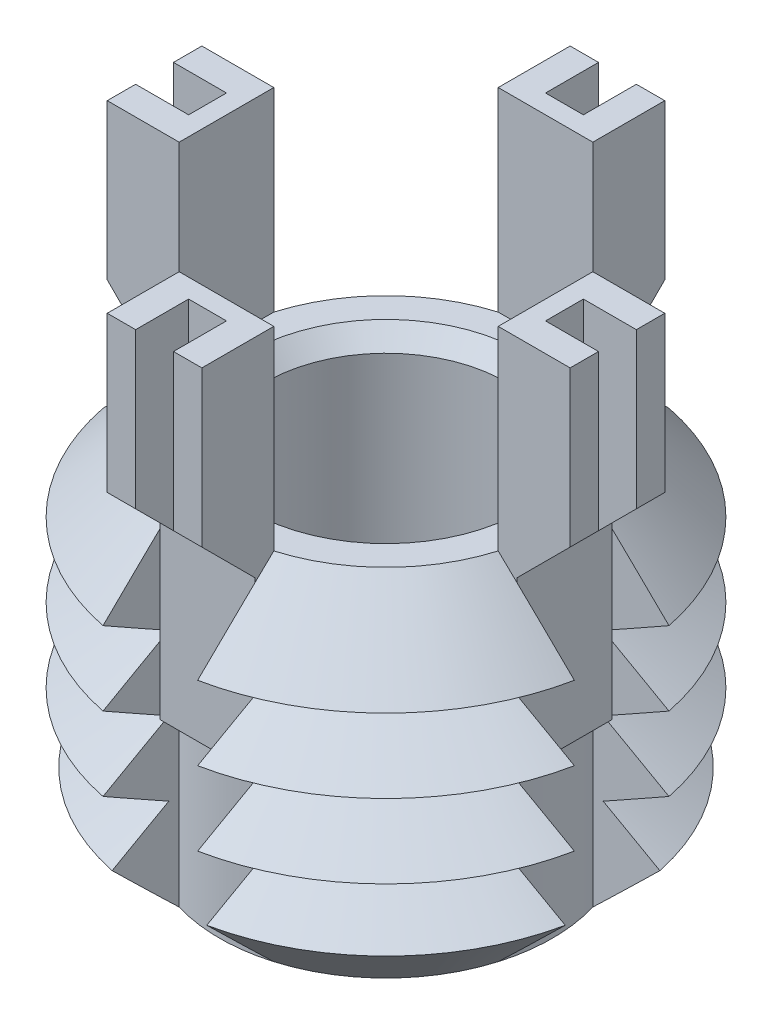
from build123d import *

# Parameters (mm, degrees)
SKETCH1_R               = 6.35
BOSS_EXTRUDE1_DEPTH     = 9.398
CHAMFER1_SIZE           = 1.954
LPATTERN1_COUNT         = 3
LPATTERN1_PITCH         = 1.954
CUT_EXTRUDE1_REACH      = 14.999
CIRPATTERN1_COUNT       = 4
BOSS_EXTRUDE3_DEPTH     = 1.25
CIRPATTERN2_COUNT       = 4
CUT_EXTRUDE3_DEPTH      = 17.994566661
CUT_EXTRUDE3_DEPTH_BACK = 17.994566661
SKETCH6_W               = 1.4
SKETCH6_H               = 1
SKETCH6_W_2             = 1
SKETCH6_H_2             = 1.4
SKETCH7_R               = 3.175
CUT_EXTRUDE4_DEPTH      = 9.398
CHAMFER2_SIZE           = 0.4535


with BuildPart() as part:
    # Sketch1 → Boss-Extrude1 (new body)
    with BuildSketch(Plane(origin=(0, 0, 0), x_dir=(1, 0, 0), z_dir=(0, 1, 0))):
        with Locations(Location((0, 0, 0), (0, 0, 270))):
            Circle(SKETCH1_R)
    extrude(amount=-BOSS_EXTRUDE1_DEPTH)

    # Chamfer1
    chamfer1_edges = [part.edges().sort_by_distance(p)[0] for p in [
        (0, 0, -6.35),
        (0, -9.398, -6.35),
    ]]
    chamfer(chamfer1_edges, length=CHAMFER1_SIZE)

    # Sketch3 → Cut-Revolve1 (revolve, cut)
    with BuildSketch(Plane(origin=(0, 0, 0), x_dir=(0, 0, -1), z_dir=(1, 0, 0))):
        Polygon((-6.35, -1.954), (-4.657786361, -2.931), (-6.35, -3.908), align=None)
    cut_revolve1 = revolve(axis=Axis((0, 0.885892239, 0), (0, -1, 0)), mode=Mode.SUBTRACT)

    # LPattern1: Cut-Revolve1 ×3
    with Locations(*[(0, -i * LPATTERN1_PITCH, 0) for i in range(1, LPATTERN1_COUNT)]):
        add(cut_revolve1, mode=Mode.SUBTRACT)

    # Cut-Extrude1: up to this cone (the profile starts inside it)
    cut_extrude1_end = Plane(origin=(0, 0, 0), z_dir=(0, 1, 0)).offset(-13.793999) * Cone(1e-06, 43.087, 43.086999, align=(Align.CENTER, Align.CENTER, Align.MIN), mode=Mode.PRIVATE)
    # Sketch4 → Cut-Extrude1 (cut, up to the surface)
    with BuildSketch(Plane(origin=(0, 0, 0), x_dir=(1, 0, 0), z_dir=(0, 1, 0)), mode=Mode.PRIVATE) as cut_extrude1_sk1:
        with BuildLine():
            Line((-4.214536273, 1.25), (-6.225752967, 1.25))
            ThreePointArc((-6.225752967, 1.25), (-6.35, 0), (-6.225752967, -1.25))
            Line((-6.225752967, -1.25), (-4.214536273, -1.25))
            ThreePointArc((-4.214536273, -1.25), (-4.396, 0), (-4.214536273, 1.25))
        make_face()
    cut_extrude1_tool1 = extrude(cut_extrude1_sk1.sketch, amount=-CUT_EXTRUDE1_REACH, mode=Mode.PRIVATE) & cut_extrude1_end
    cut_extrude1 = cut_extrude1_tool1.solids().sort_by_distance((-5.321994, 0, 0))[0]
    add(cut_extrude1, mode=Mode.SUBTRACT)

    # CirPattern1: Cut-Extrude1 ×4 about axis
    cirpattern1_axis = Axis((0, 0, 0), (0, 1, 0))
    for i in range(1, CIRPATTERN1_COUNT):
        add(cut_extrude1.rotate(cirpattern1_axis, i * 360 / CIRPATTERN1_COUNT), mode=Mode.SUBTRACT)

    # Sketch5 → Boss-Extrude3 (add, symmetric)
    with BuildSketch(Plane(origin=(0, 0, 0), x_dir=(0, 0, -1), z_dir=(1, 0, 0))):
        Polygon((-4.214536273, 5.138), (-4.214536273, -4.862), (-4.714536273, -4.862), (-4.714536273, -0.362), (-6.114536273, 1.038), (-6.114536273, 5.138), align=None)
    boss_extrude3 = extrude(amount=BOSS_EXTRUDE3_DEPTH, both=True)

    # CirPattern2: Boss-Extrude3 ×4 about axis
    cirpattern2_axis = Axis((0, 0, 0), (0, 1, 0))
    for i in range(1, CIRPATTERN2_COUNT):
        add(boss_extrude3.rotate(cirpattern2_axis, i * 360 / CIRPATTERN2_COUNT))

    # Sketch6 → Cut-Extrude3 (cut, two sides: drawn at the far end of the back side and taken through both)
    with BuildSketch(Plane(origin=(0, 5.138, 0), x_dir=(1, 0, 0), z_dir=(0, 1, 0)).offset(-CUT_EXTRUDE3_DEPTH_BACK)):
        with Locations((-5.414536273, 0)):
            Rectangle(SKETCH6_W, SKETCH6_H)
        with Locations((0, 5.414536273)):
            Rectangle(SKETCH6_W_2, SKETCH6_H_2)
        with Locations((5.414536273, 0)):
            Rectangle(SKETCH6_W, SKETCH6_H)
        with Locations((0, -5.414536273)):
            Rectangle(SKETCH6_W_2, SKETCH6_H_2)
    extrude(amount=CUT_EXTRUDE3_DEPTH + CUT_EXTRUDE3_DEPTH_BACK, mode=Mode.SUBTRACT)

    # Sketch7 → Cut-Extrude4 (cut)
    with BuildSketch(Plane(origin=(0, 0, 0), x_dir=(1, 0, 0), z_dir=(0, 1, 0))):
        with Locations(Location((0, 0, 0), (0, 0, 270))):
            Circle(SKETCH7_R)
    extrude(amount=-CUT_EXTRUDE4_DEPTH, mode=Mode.SUBTRACT)

    # Chamfer2
    chamfer2_edges = [part.edges().sort_by_distance(p)[0] for p in [
        (0, 0, -3.175),
        (0, -9.398, -3.175),
    ]]
    chamfer(chamfer2_edges, length=CHAMFER2_SIZE)


solid = part.part
